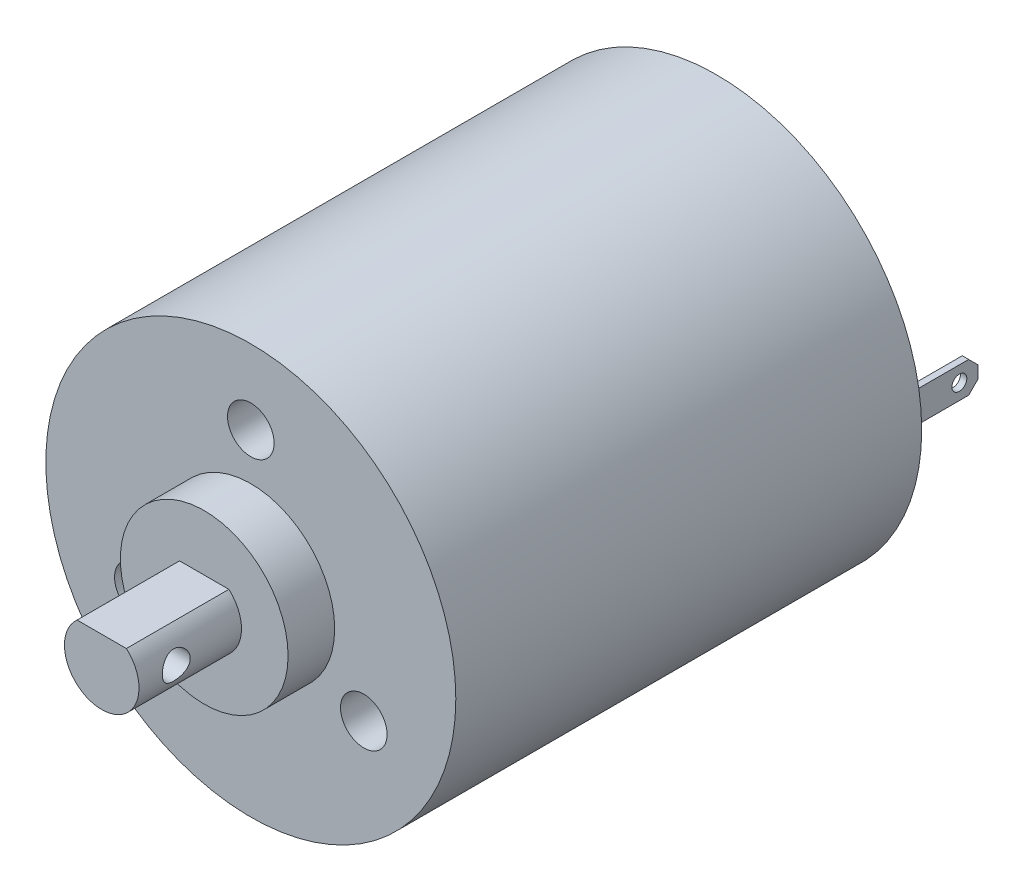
ISO-10303-21;
HEADER;
FILE_DESCRIPTION(('STEP AP214'),'2;1');
FILE_NAME('part.step','',(''),(''),'','','');
FILE_SCHEMA(('AUTOMOTIVE_DESIGN { 1 0 10303 214 1 1 1 1 }'));
ENDSEC;
DATA;
#1=APPLICATION_CONTEXT('core data for automotive mechanical design processes');
#2=APPLICATION_PROTOCOL_DEFINITION('international standard','automotive_design',2000,#1);
#3=PRODUCT_CONTEXT('',#1,'mechanical');
#4=PRODUCT('Part','Part','',(#3));
#5=PRODUCT_RELATED_PRODUCT_CATEGORY('part','',(#4));
#6=PRODUCT_DEFINITION_FORMATION('','',#4);
#7=PRODUCT_DEFINITION_CONTEXT('part definition',#1,'design');
#8=PRODUCT_DEFINITION('design','',#6,#7);
#9=PRODUCT_DEFINITION_SHAPE('','',#8);
#10=(LENGTH_UNIT() NAMED_UNIT(*) SI_UNIT(.MILLI.,.METRE.));
#11=(NAMED_UNIT(*) PLANE_ANGLE_UNIT() SI_UNIT($,.RADIAN.));
#12=(NAMED_UNIT(*) SI_UNIT($,.STERADIAN.) SOLID_ANGLE_UNIT());
#13=UNCERTAINTY_MEASURE_WITH_UNIT(LENGTH_MEASURE(1.E-05),#10,'distance_accuracy_value','');
#14=(GEOMETRIC_REPRESENTATION_CONTEXT(3) GLOBAL_UNCERTAINTY_ASSIGNED_CONTEXT((#13)) GLOBAL_UNIT_ASSIGNED_CONTEXT((#10,
#11,#12)) REPRESENTATION_CONTEXT('',''));
#15=CARTESIAN_POINT('',(0.,0.,0.));
#16=DIRECTION('',(0.,0.,1.));
#17=DIRECTION('',(1.,0.,0.));
#18=AXIS2_PLACEMENT_3D('',#15,#16,#17);
#19=CARTESIAN_POINT('',(0.,0.,-25.));
#20=DIRECTION('',(0.,0.,1.));
#21=DIRECTION('',(1.,0.,0.));
#22=AXIS2_PLACEMENT_3D('',#19,#20,#21);
#23=PLANE('',#22);
#24=DIRECTION('',(0.,-1.,0.));
#25=VECTOR('',#24,1.);
#26=CARTESIAN_POINT('',(9.82023130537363,0.832619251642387,-25.));
#27=LINE('',#26,#25);
#28=CARTESIAN_POINT('',(9.82023130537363,0.832619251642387,-25.));
#29=VERTEX_POINT('',#28);
#30=CARTESIAN_POINT('',(9.82023130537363,-0.832619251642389,-25.));
#31=VERTEX_POINT('',#30);
#32=EDGE_CURVE('E173',#29,#31,#27,.T.);
#33=ORIENTED_EDGE('',*,*,#32,.F.);
#34=DIRECTION('',(1.,0.,0.));
#35=VECTOR('',#34,1.);
#36=CARTESIAN_POINT('',(9.82023130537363,0.832619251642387,-25.));
#37=LINE('',#36,#35);
#38=CARTESIAN_POINT('',(9.47528495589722,0.832619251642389,-25.));
#39=VERTEX_POINT('',#38);
#40=EDGE_CURVE('E182',#39,#29,#37,.T.);
#41=ORIENTED_EDGE('',*,*,#40,.F.);
#42=DIRECTION('',(0.,1.,0.));
#43=VECTOR('',#42,1.);
#44=CARTESIAN_POINT('',(9.47528495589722,0.832619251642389,-25.));
#45=LINE('',#44,#43);
#46=CARTESIAN_POINT('',(9.47528495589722,-0.832619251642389,-25.));
#47=VERTEX_POINT('',#46);
#48=EDGE_CURVE('E179',#47,#39,#45,.T.);
#49=ORIENTED_EDGE('',*,*,#48,.F.);
#50=DIRECTION('',(-1.,0.,0.));
#51=VECTOR('',#50,1.);
#52=CARTESIAN_POINT('',(9.82023130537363,-0.832619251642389,-25.));
#53=LINE('',#52,#51);
#54=EDGE_CURVE('E176',#31,#47,#53,.T.);
#55=ORIENTED_EDGE('',*,*,#54,.F.);
#56=EDGE_LOOP('',(#33,#41,#49,#55));
#57=FACE_BOUND('',#56,.T.);
#58=CARTESIAN_POINT('',(0.,0.,-25.));
#59=DIRECTION('',(0.,0.,1.));
#60=DIRECTION('',(1.,0.,0.));
#61=AXIS2_PLACEMENT_3D('',#58,#59,#60);
#62=CIRCLE('',#61,11.);
#63=CARTESIAN_POINT('',(11.,0.,-25.));
#64=VERTEX_POINT('',#63);
#65=EDGE_CURVE('E242',#64,#64,#62,.T.);
#66=ORIENTED_EDGE('',*,*,#65,.F.);
#67=EDGE_LOOP('',(#66));
#68=FACE_BOUND('',#67,.T.);
#69=DIRECTION('',(1.,0.,0.));
#70=VECTOR('',#69,1.);
#71=CARTESIAN_POINT('',(-9.82023130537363,0.832619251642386,-25.));
#72=LINE('',#71,#70);
#73=CARTESIAN_POINT('',(-9.82023130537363,0.832619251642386,-25.));
#74=VERTEX_POINT('',#73);
#75=CARTESIAN_POINT('',(-9.47528495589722,0.832619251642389,-25.));
#76=VERTEX_POINT('',#75);
#77=EDGE_CURVE('E138',#74,#76,#72,.T.);
#78=ORIENTED_EDGE('',*,*,#77,.F.);
#79=DIRECTION('',(0.,1.,0.));
#80=VECTOR('',#79,1.);
#81=CARTESIAN_POINT('',(-9.82023130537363,0.832619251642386,-25.));
#82=LINE('',#81,#80);
#83=CARTESIAN_POINT('',(-9.82023130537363,-0.832619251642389,-25.));
#84=VERTEX_POINT('',#83);
#85=EDGE_CURVE('E150',#84,#74,#82,.T.);
#86=ORIENTED_EDGE('',*,*,#85,.F.);
#87=DIRECTION('',(-1.,0.,0.));
#88=VECTOR('',#87,1.);
#89=CARTESIAN_POINT('',(-9.82023130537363,-0.832619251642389,-25.));
#90=LINE('',#89,#88);
#91=CARTESIAN_POINT('',(-9.47528495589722,-0.832619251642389,-25.));
#92=VERTEX_POINT('',#91);
#93=EDGE_CURVE('E159',#92,#84,#90,.T.);
#94=ORIENTED_EDGE('',*,*,#93,.F.);
#95=DIRECTION('',(0.,-1.,0.));
#96=VECTOR('',#95,1.);
#97=CARTESIAN_POINT('',(-9.47528495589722,0.832619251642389,-25.));
#98=LINE('',#97,#96);
#99=EDGE_CURVE('E153',#76,#92,#98,.T.);
#100=ORIENTED_EDGE('',*,*,#99,.F.);
#101=EDGE_LOOP('',(#78,#86,#94,#100));
#102=FACE_BOUND('',#101,.T.);
#103=ADVANCED_FACE('F34',(#57,#68,#102),#23,.F.);
#104=CARTESIAN_POINT('',(0.,0.,0.));
#105=DIRECTION('',(0.,0.,1.));
#106=DIRECTION('',(1.,0.,0.));
#107=AXIS2_PLACEMENT_3D('',#104,#105,#106);
#108=PLANE('',#107);
#109=CARTESIAN_POINT('',(0.,0.,0.));
#110=DIRECTION('',(0.,0.,1.));
#111=DIRECTION('',(1.,0.,0.));
#112=AXIS2_PLACEMENT_3D('',#109,#110,#111);
#113=CIRCLE('',#112,11.);
#114=CARTESIAN_POINT('',(11.,0.,0.));
#115=VERTEX_POINT('',#114);
#116=EDGE_CURVE('E239',#115,#115,#113,.T.);
#117=ORIENTED_EDGE('',*,*,#116,.T.);
#118=EDGE_LOOP('',(#117));
#119=FACE_BOUND('',#118,.T.);
#120=CARTESIAN_POINT('',(0.,7.,0.));
#121=DIRECTION('',(0.,0.,1.));
#122=DIRECTION('',(1.,0.,0.));
#123=AXIS2_PLACEMENT_3D('',#120,#121,#122);
#124=CIRCLE('',#123,1.25);
#125=CARTESIAN_POINT('',(1.25,7.,0.));
#126=VERTEX_POINT('',#125);
#127=EDGE_CURVE('E222',#126,#126,#124,.T.);
#128=ORIENTED_EDGE('',*,*,#127,.F.);
#129=EDGE_LOOP('',(#128));
#130=FACE_BOUND('',#129,.T.);
#131=CARTESIAN_POINT('',(-6.06217782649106,-3.50000000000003,0.));
#132=DIRECTION('',(0.,0.,1.));
#133=DIRECTION('',(-0.500000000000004,0.866025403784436,0.));
#134=AXIS2_PLACEMENT_3D('',#131,#132,#133);
#135=CIRCLE('',#134,1.25);
#136=CARTESIAN_POINT('',(-6.68717782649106,-2.41746824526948,0.));
#137=VERTEX_POINT('',#136);
#138=EDGE_CURVE('E216',#137,#137,#135,.T.);
#139=ORIENTED_EDGE('',*,*,#138,.F.);
#140=EDGE_LOOP('',(#139));
#141=FACE_BOUND('',#140,.T.);
#142=CARTESIAN_POINT('',(6.0621778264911,-3.49999999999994,0.));
#143=DIRECTION('',(0.,0.,1.));
#144=DIRECTION('',(-0.499999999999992,-0.866025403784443,0.));
#145=AXIS2_PLACEMENT_3D('',#142,#143,#144);
#146=CIRCLE('',#145,1.25);
#147=CARTESIAN_POINT('',(5.43717782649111,-4.5825317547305,0.));
#148=VERTEX_POINT('',#147);
#149=EDGE_CURVE('E210',#148,#148,#146,.T.);
#150=ORIENTED_EDGE('',*,*,#149,.F.);
#151=EDGE_LOOP('',(#150));
#152=FACE_BOUND('',#151,.T.);
#153=CARTESIAN_POINT('',(0.,0.,0.));
#154=DIRECTION('',(0.,0.,1.));
#155=DIRECTION('',(1.,0.,0.));
#156=AXIS2_PLACEMENT_3D('',#153,#154,#155);
#157=CIRCLE('',#156,4.5);
#158=CARTESIAN_POINT('',(4.5,0.,0.));
#159=VERTEX_POINT('',#158);
#160=EDGE_CURVE('E200',#159,#159,#157,.T.);
#161=ORIENTED_EDGE('',*,*,#160,.F.);
#162=EDGE_LOOP('',(#161));
#163=FACE_BOUND('',#162,.T.);
#164=ADVANCED_FACE('F316',(#119,#130,#141,#152,#163),#108,.T.);
#165=CARTESIAN_POINT('',(0.,0.,-25.));
#166=DIRECTION('',(0.,0.,1.));
#167=DIRECTION('',(1.,0.,0.));
#168=AXIS2_PLACEMENT_3D('',#165,#166,#167);
#169=CYLINDRICAL_SURFACE('',#168,11.);
#170=ORIENTED_EDGE('',*,*,#65,.T.);
#171=EDGE_LOOP('',(#170));
#172=FACE_BOUND('',#171,.T.);
#173=ORIENTED_EDGE('',*,*,#116,.F.);
#174=EDGE_LOOP('',(#173));
#175=FACE_BOUND('',#174,.T.);
#176=ADVANCED_FACE('F36',(#172,#175),#169,.T.);
#177=CARTESIAN_POINT('',(0.,7.,-4.));
#178=DIRECTION('',(0.,0.,1.));
#179=DIRECTION('',(1.,0.,0.));
#180=AXIS2_PLACEMENT_3D('',#177,#178,#179);
#181=CYLINDRICAL_SURFACE('',#180,1.25);
#182=CARTESIAN_POINT('',(0.,7.,-4.));
#183=DIRECTION('',(0.,0.,1.));
#184=DIRECTION('',(1.,0.,0.));
#185=AXIS2_PLACEMENT_3D('',#182,#183,#184);
#186=CIRCLE('',#185,1.25);
#187=CARTESIAN_POINT('',(1.25,7.,-4.));
#188=VERTEX_POINT('',#187);
#189=EDGE_CURVE('E225',#188,#188,#186,.T.);
#190=ORIENTED_EDGE('',*,*,#189,.F.);
#191=EDGE_LOOP('',(#190));
#192=FACE_BOUND('',#191,.T.);
#193=ORIENTED_EDGE('',*,*,#127,.T.);
#194=EDGE_LOOP('',(#193));
#195=FACE_BOUND('',#194,.T.);
#196=ADVANCED_FACE('F301',(#192,#195),#181,.F.);
#197=CARTESIAN_POINT('',(0.,7.,-4.));
#198=DIRECTION('',(0.,0.,1.));
#199=DIRECTION('',(1.,0.,0.));
#200=AXIS2_PLACEMENT_3D('',#197,#198,#199);
#201=PLANE('',#200);
#202=ORIENTED_EDGE('',*,*,#189,.T.);
#203=EDGE_LOOP('',(#202));
#204=FACE_BOUND('',#203,.T.);
#205=ADVANCED_FACE('F297',(#204),#201,.T.);
#206=CARTESIAN_POINT('',(-6.06217782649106,-3.50000000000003,-4.));
#207=DIRECTION('',(0.,0.,1.));
#208=DIRECTION('',(1.,0.,0.));
#209=AXIS2_PLACEMENT_3D('',#206,#207,#208);
#210=CYLINDRICAL_SURFACE('',#209,1.25);
#211=CARTESIAN_POINT('',(-6.06217782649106,-3.50000000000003,-4.));
#212=DIRECTION('',(0.,0.,1.));
#213=DIRECTION('',(-0.500000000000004,0.866025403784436,0.));
#214=AXIS2_PLACEMENT_3D('',#211,#212,#213);
#215=CIRCLE('',#214,1.25);
#216=CARTESIAN_POINT('',(-6.68717782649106,-2.41746824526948,-4.));
#217=VERTEX_POINT('',#216);
#218=EDGE_CURVE('E219',#217,#217,#215,.T.);
#219=ORIENTED_EDGE('',*,*,#218,.F.);
#220=EDGE_LOOP('',(#219));
#221=FACE_BOUND('',#220,.T.);
#222=ORIENTED_EDGE('',*,*,#138,.T.);
#223=EDGE_LOOP('',(#222));
#224=FACE_BOUND('',#223,.T.);
#225=ADVANCED_FACE('F293',(#221,#224),#210,.F.);
#226=CARTESIAN_POINT('',(-6.06217782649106,-3.50000000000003,-4.));
#227=DIRECTION('',(0.,0.,1.));
#228=DIRECTION('',(-0.500000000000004,0.866025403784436,0.));
#229=AXIS2_PLACEMENT_3D('',#226,#227,#228);
#230=PLANE('',#229);
#231=ORIENTED_EDGE('',*,*,#218,.T.);
#232=EDGE_LOOP('',(#231));
#233=FACE_BOUND('',#232,.T.);
#234=ADVANCED_FACE('F289',(#233),#230,.T.);
#235=CARTESIAN_POINT('',(6.0621778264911,-3.49999999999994,-4.));
#236=DIRECTION('',(0.,0.,1.));
#237=DIRECTION('',(1.,0.,0.));
#238=AXIS2_PLACEMENT_3D('',#235,#236,#237);
#239=CYLINDRICAL_SURFACE('',#238,1.25);
#240=CARTESIAN_POINT('',(6.0621778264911,-3.49999999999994,-4.));
#241=DIRECTION('',(0.,0.,1.));
#242=DIRECTION('',(-0.499999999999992,-0.866025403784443,0.));
#243=AXIS2_PLACEMENT_3D('',#240,#241,#242);
#244=CIRCLE('',#243,1.25);
#245=CARTESIAN_POINT('',(5.43717782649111,-4.5825317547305,-4.));
#246=VERTEX_POINT('',#245);
#247=EDGE_CURVE('E213',#246,#246,#244,.T.);
#248=ORIENTED_EDGE('',*,*,#247,.F.);
#249=EDGE_LOOP('',(#248));
#250=FACE_BOUND('',#249,.T.);
#251=ORIENTED_EDGE('',*,*,#149,.T.);
#252=EDGE_LOOP('',(#251));
#253=FACE_BOUND('',#252,.T.);
#254=ADVANCED_FACE('F285',(#250,#253),#239,.F.);
#255=CARTESIAN_POINT('',(6.0621778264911,-3.49999999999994,-4.));
#256=DIRECTION('',(0.,0.,1.));
#257=DIRECTION('',(-0.499999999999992,-0.866025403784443,0.));
#258=AXIS2_PLACEMENT_3D('',#255,#256,#257);
#259=PLANE('',#258);
#260=ORIENTED_EDGE('',*,*,#247,.T.);
#261=EDGE_LOOP('',(#260));
#262=FACE_BOUND('',#261,.T.);
#263=ADVANCED_FACE('F277',(#262),#259,.T.);
#264=CARTESIAN_POINT('',(0.,0.,2.5));
#265=DIRECTION('',(0.,0.,1.));
#266=DIRECTION('',(1.,0.,0.));
#267=AXIS2_PLACEMENT_3D('',#264,#265,#266);
#268=PLANE('',#267);
#269=CARTESIAN_POINT('',(0.,0.,2.5));
#270=DIRECTION('',(0.,0.,1.));
#271=DIRECTION('',(1.,0.,0.));
#272=AXIS2_PLACEMENT_3D('',#269,#270,#271);
#273=CIRCLE('',#272,4.5);
#274=CARTESIAN_POINT('',(4.5,0.,2.5));
#275=VERTEX_POINT('',#274);
#276=EDGE_CURVE('E203',#275,#275,#273,.T.);
#277=ORIENTED_EDGE('',*,*,#276,.T.);
#278=EDGE_LOOP('',(#277));
#279=FACE_BOUND('',#278,.T.);
#280=CARTESIAN_POINT('',(0.,0.,2.5));
#281=DIRECTION('',(0.,0.,1.));
#282=DIRECTION('',(1.,0.,0.));
#283=AXIS2_PLACEMENT_3D('',#280,#281,#282);
#284=CIRCLE('',#283,2.);
#285=CARTESIAN_POINT('',(-1.3228756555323,1.5,2.5));
#286=VERTEX_POINT('',#285);
#287=CARTESIAN_POINT('',(1.32287565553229,1.5,2.5));
#288=VERTEX_POINT('',#287);
#289=EDGE_CURVE('E207',#286,#288,#284,.T.);
#290=ORIENTED_EDGE('',*,*,#289,.F.);
#291=DIRECTION('',(-1.,0.,0.));
#292=VECTOR('',#291,1.);
#293=CARTESIAN_POINT('',(-1.3228756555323,1.5,2.5));
#294=LINE('',#293,#292);
#295=EDGE_CURVE('E245',#288,#286,#294,.T.);
#296=ORIENTED_EDGE('',*,*,#295,.F.);
#297=EDGE_LOOP('',(#290,#296));
#298=FACE_BOUND('',#297,.T.);
#299=ADVANCED_FACE('F272',(#279,#298),#268,.T.);
#300=CARTESIAN_POINT('',(0.,0.,2.5));
#301=DIRECTION('',(0.,0.,-1.));
#302=DIRECTION('',(-1.,0.,0.));
#303=AXIS2_PLACEMENT_3D('',#300,#301,#302);
#304=CYLINDRICAL_SURFACE('',#303,4.5);
#305=ORIENTED_EDGE('',*,*,#276,.F.);
#306=EDGE_LOOP('',(#305));
#307=FACE_BOUND('',#306,.T.);
#308=ORIENTED_EDGE('',*,*,#160,.T.);
#309=EDGE_LOOP('',(#308));
#310=FACE_BOUND('',#309,.T.);
#311=ADVANCED_FACE('F276',(#307,#310),#304,.T.);
#312=CARTESIAN_POINT('',(0.,0.,8.));
#313=DIRECTION('',(0.,0.,1.));
#314=DIRECTION('',(1.,0.,0.));
#315=AXIS2_PLACEMENT_3D('',#312,#313,#314);
#316=PLANE('',#315);
#317=CARTESIAN_POINT('',(0.,0.,8.));
#318=DIRECTION('',(0.,0.,1.));
#319=DIRECTION('',(1.,0.,0.));
#320=AXIS2_PLACEMENT_3D('',#317,#318,#319);
#321=CIRCLE('',#320,2.);
#322=CARTESIAN_POINT('',(-1.3228756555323,1.5,8.));
#323=VERTEX_POINT('',#322);
#324=CARTESIAN_POINT('',(1.3228756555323,1.5,8.));
#325=VERTEX_POINT('',#324);
#326=EDGE_CURVE('E228',#323,#325,#321,.T.);
#327=ORIENTED_EDGE('',*,*,#326,.T.);
#328=DIRECTION('',(-1.,0.,0.));
#329=VECTOR('',#328,1.);
#330=CARTESIAN_POINT('',(-1.3228756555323,1.5,8.));
#331=LINE('',#330,#329);
#332=EDGE_CURVE('E231',#325,#323,#331,.T.);
#333=ORIENTED_EDGE('',*,*,#332,.T.);
#334=EDGE_LOOP('',(#327,#333));
#335=FACE_BOUND('',#334,.T.);
#336=ADVANCED_FACE('F281',(#335),#316,.T.);
#337=CARTESIAN_POINT('',(-1.3228756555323,1.5,8.));
#338=DIRECTION('',(0.,-1.,0.));
#339=DIRECTION('',(0.,0.,-1.));
#340=AXIS2_PLACEMENT_3D('',#337,#338,#339);
#341=PLANE('',#340);
#342=DIRECTION('',(0.,0.,-1.));
#343=VECTOR('',#342,1.);
#344=CARTESIAN_POINT('',(1.3228756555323,1.5,8.));
#345=LINE('',#344,#343);
#346=EDGE_CURVE('E236',#325,#288,#345,.T.);
#347=ORIENTED_EDGE('',*,*,#346,.T.);
#348=ORIENTED_EDGE('',*,*,#295,.T.);
#349=DIRECTION('',(0.,0.,-1.));
#350=VECTOR('',#349,1.);
#351=CARTESIAN_POINT('',(-1.3228756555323,1.5,8.));
#352=LINE('',#351,#350);
#353=EDGE_CURVE('E233',#323,#286,#352,.T.);
#354=ORIENTED_EDGE('',*,*,#353,.F.);
#355=ORIENTED_EDGE('',*,*,#332,.F.);
#356=EDGE_LOOP('',(#347,#348,#354,#355));
#357=FACE_BOUND('',#356,.T.);
#358=ADVANCED_FACE('F307',(#357),#341,.F.);
#359=CARTESIAN_POINT('',(0.,0.,8.));
#360=DIRECTION('',(0.,0.,-1.));
#361=DIRECTION('',(-1.,0.,0.));
#362=AXIS2_PLACEMENT_3D('',#359,#360,#361);
#363=CYLINDRICAL_SURFACE('',#362,2.);
#364=CARTESIAN_POINT('',(-2.,0.,5.25));
#365=CARTESIAN_POINT('',(-2.00000108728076,0.0406175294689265,5.24999854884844));
#366=CARTESIAN_POINT('',(-1.99875189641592,0.0812251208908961,5.25330988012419));
#367=CARTESIAN_POINT('',(-1.99389348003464,0.161226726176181,5.26641409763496));
#368=CARTESIAN_POINT('',(-1.99028459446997,0.200620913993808,5.27620605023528));
#369=CARTESIAN_POINT('',(-1.98109416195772,0.277030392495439,5.30187650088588));
#370=CARTESIAN_POINT('',(-1.9755164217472,0.314050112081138,5.31774325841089));
#371=CARTESIAN_POINT('',(-1.96294383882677,0.384899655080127,5.35505320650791));
#372=CARTESIAN_POINT('',(-1.95594861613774,0.418728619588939,5.37649789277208));
#373=CARTESIAN_POINT('',(-1.94093123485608,0.483673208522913,5.42530626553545));
#374=CARTESIAN_POINT('',(-1.93288001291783,0.514635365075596,5.4528651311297));
#375=CARTESIAN_POINT('',(-1.91680110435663,0.571622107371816,5.51270521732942));
#376=CARTESIAN_POINT('',(-1.90877342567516,0.597645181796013,5.54498787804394));
#377=CARTESIAN_POINT('',(-1.89331235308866,0.644991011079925,5.6148587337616));
#378=CARTESIAN_POINT('',(-1.88591324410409,0.666096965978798,5.65260218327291));
#379=CARTESIAN_POINT('',(-1.87299930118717,0.701593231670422,5.73142417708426));
#380=CARTESIAN_POINT('',(-1.8674837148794,0.715986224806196,5.77250138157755));
#381=CARTESIAN_POINT('',(-1.85927206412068,0.737042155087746,5.8550583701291));
#382=CARTESIAN_POINT('',(-1.85646962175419,0.743997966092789,5.89645251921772));
#383=CARTESIAN_POINT('',(-1.85369030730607,0.75089778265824,5.97990807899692));
#384=CARTESIAN_POINT('',(-1.85371226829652,0.750844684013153,6.02196920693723));
#385=CARTESIAN_POINT('',(-1.85648755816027,0.743952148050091,6.10288476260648));
#386=CARTESIAN_POINT('',(-1.85907734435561,0.737519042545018,6.14178045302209));
#387=CARTESIAN_POINT('',(-1.86642469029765,0.71872083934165,6.21789357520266));
#388=CARTESIAN_POINT('',(-1.87118257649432,0.706354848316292,6.25511075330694));
#389=CARTESIAN_POINT('',(-1.88242851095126,0.67581874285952,6.32763853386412));
#390=CARTESIAN_POINT('',(-1.88894758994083,0.657543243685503,6.36289974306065));
#391=CARTESIAN_POINT('',(-1.9029710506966,0.615780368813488,6.42997286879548));
#392=CARTESIAN_POINT('',(-1.91047577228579,0.592291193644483,6.46178358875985));
#393=CARTESIAN_POINT('',(-1.92624019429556,0.538908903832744,6.52330183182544));
#394=CARTESIAN_POINT('',(-1.93451673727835,0.508691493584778,6.55272432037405));
#395=CARTESIAN_POINT('',(-1.95045864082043,0.44365629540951,6.6061689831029));
#396=CARTESIAN_POINT('',(-1.95812390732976,0.408837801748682,6.63019032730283));
#397=CARTESIAN_POINT('',(-1.9721319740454,0.33486171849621,6.67246519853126));
#398=CARTESIAN_POINT('',(-1.97845249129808,0.29564535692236,6.69062379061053));
#399=CARTESIAN_POINT('',(-1.98889359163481,0.214418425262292,6.71999130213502));
#400=CARTESIAN_POINT('',(-1.99301515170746,0.172409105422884,6.73120330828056));
#401=CARTESIAN_POINT('',(-1.99842221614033,0.0891876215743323,6.74581139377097));
#402=CARTESIAN_POINT('',(-1.99984684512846,0.0480518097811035,6.74959130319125));
#403=CARTESIAN_POINT('',(-2.0001294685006,-0.0342862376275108,6.75034553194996));
#404=CARTESIAN_POINT('',(-1.99898803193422,-0.0754884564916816,6.7473213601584));
#405=CARTESIAN_POINT('',(-1.99435854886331,-0.155131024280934,6.73484497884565));
#406=CARTESIAN_POINT('',(-1.99096235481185,-0.193616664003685,6.72564422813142));
#407=CARTESIAN_POINT('',(-1.98225738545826,-0.268470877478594,6.70140696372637));
#408=CARTESIAN_POINT('',(-1.97694836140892,-0.304839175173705,6.68636969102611));
#409=CARTESIAN_POINT('',(-1.96474812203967,-0.375623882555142,6.65040679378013));
#410=CARTESIAN_POINT('',(-1.95781500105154,-0.409951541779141,6.62932113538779));
#411=CARTESIAN_POINT('',(-1.94313335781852,-0.474696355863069,6.58204094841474));
#412=CARTESIAN_POINT('',(-1.93538453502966,-0.505112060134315,6.55584453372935));
#413=CARTESIAN_POINT('',(-1.91936664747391,-0.563015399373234,6.49729793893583));
#414=CARTESIAN_POINT('',(-1.91109348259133,-0.590230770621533,6.46467890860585));
#415=CARTESIAN_POINT('',(-1.89539407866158,-0.638855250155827,6.39517430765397));
#416=CARTESIAN_POINT('',(-1.88796791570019,-0.660263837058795,6.35828835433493));
#417=CARTESIAN_POINT('',(-1.87483414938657,-0.696688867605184,6.28099200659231));
#418=CARTESIAN_POINT('',(-1.86913380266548,-0.711678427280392,6.24056762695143));
#419=CARTESIAN_POINT('',(-1.86027016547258,-0.734539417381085,6.15749511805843));
#420=CARTESIAN_POINT('',(-1.85710530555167,-0.742415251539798,6.11484838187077));
#421=CARTESIAN_POINT('',(-1.85387947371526,-0.750431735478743,6.03149192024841));
#422=CARTESIAN_POINT('',(-1.85363222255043,-0.751036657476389,5.99083368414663));
#423=CARTESIAN_POINT('',(-1.85579206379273,-0.745683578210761,5.91002734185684));
#424=CARTESIAN_POINT('',(-1.858198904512,-0.739726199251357,5.86987918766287));
#425=CARTESIAN_POINT('',(-1.86524070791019,-0.721779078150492,5.79247638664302));
#426=CARTESIAN_POINT('',(-1.86980542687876,-0.709978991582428,5.75517082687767));
#427=CARTESIAN_POINT('',(-1.88060774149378,-0.680848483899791,5.68304724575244));
#428=CARTESIAN_POINT('',(-1.88684575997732,-0.663516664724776,5.64822985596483));
#429=CARTESIAN_POINT('',(-1.90069861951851,-0.622760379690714,5.58008660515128));
#430=CARTESIAN_POINT('',(-1.90836849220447,-0.599064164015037,5.54693460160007));
#431=CARTESIAN_POINT('',(-1.92403123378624,-0.546672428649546,5.48492921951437));
#432=CARTESIAN_POINT('',(-1.93202420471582,-0.517975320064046,5.45607721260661));
#433=CARTESIAN_POINT('',(-1.9479521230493,-0.454540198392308,5.40189902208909));
#434=CARTESIAN_POINT('',(-1.9558605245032,-0.419559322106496,5.37684812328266));
#435=CARTESIAN_POINT('',(-1.97027257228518,-0.345606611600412,5.33298867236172));
#436=CARTESIAN_POINT('',(-1.9767761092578,-0.306634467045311,5.31418060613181));
#437=CARTESIAN_POINT('',(-1.98787146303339,-0.223999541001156,5.28281158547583));
#438=CARTESIAN_POINT('',(-1.99236828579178,-0.180206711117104,5.27055646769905));
#439=CARTESIAN_POINT('',(-1.99843121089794,-0.090937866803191,5.25415352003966));
#440=CARTESIAN_POINT('',(-1.99999878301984,-0.0454627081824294,5.25000162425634));
#441=CARTESIAN_POINT('',(-2.,0.,5.25));
#442=B_SPLINE_CURVE_WITH_KNOTS('',3,(#364,#365,#366,#367,#368,#369,#370,#371,#372,#373,#374,
#375,#376,#377,#378,#379,#380,#381,#382,#383,#384,#385,#386,#387,#388,#389,#390,#391,#392,#393,
#394,#395,#396,#397,#398,#399,#400,#401,#402,#403,#404,#405,#406,#407,#408,#409,#410,#411,#412,
#413,#414,#415,#416,#417,#418,#419,#420,#421,#422,#423,#424,#425,#426,#427,#428,#429,#430,#431,
#432,#433,#434,#435,#436,#437,#438,#439,#440,#441),.UNSPECIFIED.,.T.,.F.,(4,2,2,2,2,2,2,2,2,2,2,
2,2,2,2,2,2,2,2,2,2,2,2,2,2,2,2,2,2,2,2,2,2,2,2,2,2,2,4),(0.,0.12168490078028,0.24335227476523,
0.364785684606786,0.486251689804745,0.612368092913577,0.738523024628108,0.869483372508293,
1.00039134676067,1.12592937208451,1.25141553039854,1.36939172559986,1.48738569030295,
1.60761204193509,1.72787995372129,1.85623076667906,1.98460128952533,2.11495687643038,
2.24525449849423,2.36862509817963,2.4919683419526,2.6105721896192,2.72919146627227,
2.851296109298,2.97344590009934,3.10268259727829,3.23193089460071,3.36171533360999,
3.49141937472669,3.61279381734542,3.73415675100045,3.85181571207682,3.96950443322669,
4.09336235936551,4.21725970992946,4.34786164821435,4.47847374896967,4.61474257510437,
4.75094300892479),.UNSPECIFIED.);
#443=CARTESIAN_POINT('',(-2.,0.,5.25));
#444=VERTEX_POINT('',#443);
#445=EDGE_CURVE('E204',#444,#444,#442,.T.);
#446=ORIENTED_EDGE('',*,*,#445,.T.);
#447=EDGE_LOOP('',(#446));
#448=FACE_BOUND('',#447,.T.);
#449=CARTESIAN_POINT('',(2.,0.,5.25));
#450=CARTESIAN_POINT('',(2.00000108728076,-0.0406175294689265,5.24999854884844));
#451=CARTESIAN_POINT('',(1.99875189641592,-0.0812251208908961,5.25330988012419));
#452=CARTESIAN_POINT('',(1.99389348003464,-0.161226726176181,5.26641409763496));
#453=CARTESIAN_POINT('',(1.99028459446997,-0.200620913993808,5.27620605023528));
#454=CARTESIAN_POINT('',(1.98109416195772,-0.277030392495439,5.30187650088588));
#455=CARTESIAN_POINT('',(1.9755164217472,-0.314050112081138,5.31774325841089));
#456=CARTESIAN_POINT('',(1.96294383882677,-0.384899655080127,5.35505320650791));
#457=CARTESIAN_POINT('',(1.95594861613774,-0.418728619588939,5.37649789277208));
#458=CARTESIAN_POINT('',(1.94093123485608,-0.483673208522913,5.42530626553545));
#459=CARTESIAN_POINT('',(1.93288001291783,-0.514635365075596,5.4528651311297));
#460=CARTESIAN_POINT('',(1.91680110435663,-0.571622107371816,5.51270521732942));
#461=CARTESIAN_POINT('',(1.90877342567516,-0.597645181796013,5.54498787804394));
#462=CARTESIAN_POINT('',(1.89331235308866,-0.644991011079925,5.6148587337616));
#463=CARTESIAN_POINT('',(1.88591324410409,-0.666096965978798,5.65260218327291));
#464=CARTESIAN_POINT('',(1.87299930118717,-0.701593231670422,5.73142417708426));
#465=CARTESIAN_POINT('',(1.8674837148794,-0.715986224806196,5.77250138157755));
#466=CARTESIAN_POINT('',(1.85927206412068,-0.737042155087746,5.8550583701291));
#467=CARTESIAN_POINT('',(1.85646962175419,-0.743997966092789,5.89645251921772));
#468=CARTESIAN_POINT('',(1.85369030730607,-0.75089778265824,5.97990807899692));
#469=CARTESIAN_POINT('',(1.85371226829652,-0.750844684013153,6.02196920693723));
#470=CARTESIAN_POINT('',(1.85648755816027,-0.743952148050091,6.10288476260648));
#471=CARTESIAN_POINT('',(1.85907734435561,-0.737519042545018,6.14178045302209));
#472=CARTESIAN_POINT('',(1.86642469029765,-0.71872083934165,6.21789357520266));
#473=CARTESIAN_POINT('',(1.87118257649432,-0.706354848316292,6.25511075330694));
#474=CARTESIAN_POINT('',(1.88242851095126,-0.67581874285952,6.32763853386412));
#475=CARTESIAN_POINT('',(1.88894758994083,-0.657543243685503,6.36289974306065));
#476=CARTESIAN_POINT('',(1.9029710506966,-0.615780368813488,6.42997286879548));
#477=CARTESIAN_POINT('',(1.91047577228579,-0.592291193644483,6.46178358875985));
#478=CARTESIAN_POINT('',(1.92624019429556,-0.538908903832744,6.52330183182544));
#479=CARTESIAN_POINT('',(1.93451673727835,-0.508691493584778,6.55272432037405));
#480=CARTESIAN_POINT('',(1.95045864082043,-0.44365629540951,6.6061689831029));
#481=CARTESIAN_POINT('',(1.95812390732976,-0.408837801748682,6.63019032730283));
#482=CARTESIAN_POINT('',(1.9721319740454,-0.33486171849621,6.67246519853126));
#483=CARTESIAN_POINT('',(1.97845249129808,-0.29564535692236,6.69062379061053));
#484=CARTESIAN_POINT('',(1.98889359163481,-0.214418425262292,6.71999130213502));
#485=CARTESIAN_POINT('',(1.99301515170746,-0.172409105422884,6.73120330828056));
#486=CARTESIAN_POINT('',(1.99842221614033,-0.0891876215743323,6.74581139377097));
#487=CARTESIAN_POINT('',(1.99984684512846,-0.0480518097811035,6.74959130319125));
#488=CARTESIAN_POINT('',(2.0001294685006,0.0342862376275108,6.75034553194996));
#489=CARTESIAN_POINT('',(1.99898803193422,0.0754884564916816,6.7473213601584));
#490=CARTESIAN_POINT('',(1.99435854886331,0.155131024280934,6.73484497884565));
#491=CARTESIAN_POINT('',(1.99096235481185,0.193616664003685,6.72564422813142));
#492=CARTESIAN_POINT('',(1.98225738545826,0.268470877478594,6.70140696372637));
#493=CARTESIAN_POINT('',(1.97694836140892,0.304839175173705,6.68636969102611));
#494=CARTESIAN_POINT('',(1.96474812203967,0.375623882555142,6.65040679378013));
#495=CARTESIAN_POINT('',(1.95781500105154,0.409951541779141,6.62932113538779));
#496=CARTESIAN_POINT('',(1.94313335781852,0.474696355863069,6.58204094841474));
#497=CARTESIAN_POINT('',(1.93538453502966,0.505112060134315,6.55584453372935));
#498=CARTESIAN_POINT('',(1.91936664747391,0.563015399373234,6.49729793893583));
#499=CARTESIAN_POINT('',(1.91109348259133,0.590230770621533,6.46467890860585));
#500=CARTESIAN_POINT('',(1.89539407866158,0.638855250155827,6.39517430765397));
#501=CARTESIAN_POINT('',(1.88796791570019,0.660263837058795,6.35828835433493));
#502=CARTESIAN_POINT('',(1.87483414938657,0.696688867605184,6.28099200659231));
#503=CARTESIAN_POINT('',(1.86913380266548,0.711678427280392,6.24056762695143));
#504=CARTESIAN_POINT('',(1.86027016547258,0.734539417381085,6.15749511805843));
#505=CARTESIAN_POINT('',(1.85710530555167,0.742415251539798,6.11484838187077));
#506=CARTESIAN_POINT('',(1.85387947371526,0.750431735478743,6.03149192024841));
#507=CARTESIAN_POINT('',(1.85363222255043,0.751036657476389,5.99083368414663));
#508=CARTESIAN_POINT('',(1.85579206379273,0.745683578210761,5.91002734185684));
#509=CARTESIAN_POINT('',(1.858198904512,0.739726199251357,5.86987918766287));
#510=CARTESIAN_POINT('',(1.86524070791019,0.721779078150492,5.79247638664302));
#511=CARTESIAN_POINT('',(1.86980542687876,0.709978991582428,5.75517082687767));
#512=CARTESIAN_POINT('',(1.88060774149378,0.680848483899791,5.68304724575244));
#513=CARTESIAN_POINT('',(1.88684575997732,0.663516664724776,5.64822985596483));
#514=CARTESIAN_POINT('',(1.90069861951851,0.622760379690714,5.58008660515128));
#515=CARTESIAN_POINT('',(1.90836849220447,0.599064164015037,5.54693460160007));
#516=CARTESIAN_POINT('',(1.92403123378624,0.546672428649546,5.48492921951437));
#517=CARTESIAN_POINT('',(1.93202420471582,0.517975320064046,5.45607721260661));
#518=CARTESIAN_POINT('',(1.9479521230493,0.454540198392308,5.40189902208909));
#519=CARTESIAN_POINT('',(1.9558605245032,0.419559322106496,5.37684812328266));
#520=CARTESIAN_POINT('',(1.97027257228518,0.345606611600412,5.33298867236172));
#521=CARTESIAN_POINT('',(1.9767761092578,0.306634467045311,5.31418060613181));
#522=CARTESIAN_POINT('',(1.98787146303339,0.223999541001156,5.28281158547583));
#523=CARTESIAN_POINT('',(1.99236828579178,0.180206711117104,5.27055646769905));
#524=CARTESIAN_POINT('',(1.99843121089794,0.090937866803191,5.25415352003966));
#525=CARTESIAN_POINT('',(1.99999878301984,0.0454627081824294,5.25000162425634));
#526=CARTESIAN_POINT('',(2.,0.,5.25));
#527=B_SPLINE_CURVE_WITH_KNOTS('',3,(#449,#450,#451,#452,#453,#454,#455,#456,#457,#458,#459,
#460,#461,#462,#463,#464,#465,#466,#467,#468,#469,#470,#471,#472,#473,#474,#475,#476,#477,#478,
#479,#480,#481,#482,#483,#484,#485,#486,#487,#488,#489,#490,#491,#492,#493,#494,#495,#496,#497,
#498,#499,#500,#501,#502,#503,#504,#505,#506,#507,#508,#509,#510,#511,#512,#513,#514,#515,#516,
#517,#518,#519,#520,#521,#522,#523,#524,#525,#526),.UNSPECIFIED.,.T.,.F.,(4,2,2,2,2,2,2,2,2,2,2,
2,2,2,2,2,2,2,2,2,2,2,2,2,2,2,2,2,2,2,2,2,2,2,2,2,2,2,4),(0.,0.12168490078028,0.24335227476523,
0.364785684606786,0.486251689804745,0.612368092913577,0.738523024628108,0.869483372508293,
1.00039134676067,1.12592937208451,1.25141553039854,1.36939172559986,1.48738569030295,
1.60761204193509,1.72787995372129,1.85623076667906,1.98460128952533,2.11495687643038,
2.24525449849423,2.36862509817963,2.4919683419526,2.6105721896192,2.72919146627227,
2.851296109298,2.97344590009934,3.10268259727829,3.23193089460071,3.36171533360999,
3.49141937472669,3.61279381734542,3.73415675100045,3.85181571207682,3.96950443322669,
4.09336235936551,4.21725970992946,4.34786164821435,4.47847374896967,4.61474257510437,
4.75094300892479),.UNSPECIFIED.);
#528=CARTESIAN_POINT('',(2.,0.,5.25));
#529=VERTEX_POINT('',#528);
#530=EDGE_CURVE('E199',#529,#529,#527,.T.);
#531=ORIENTED_EDGE('',*,*,#530,.T.);
#532=EDGE_LOOP('',(#531));
#533=FACE_BOUND('',#532,.T.);
#534=ORIENTED_EDGE('',*,*,#353,.T.);
#535=ORIENTED_EDGE('',*,*,#289,.T.);
#536=ORIENTED_EDGE('',*,*,#346,.F.);
#537=ORIENTED_EDGE('',*,*,#326,.F.);
#538=EDGE_LOOP('',(#534,#535,#536,#537));
#539=FACE_BOUND('',#538,.T.);
#540=ADVANCED_FACE('F260',(#448,#533,#539),#363,.T.);
#541=CARTESIAN_POINT('',(-11.,0.,6.));
#542=DIRECTION('',(1.,0.,0.));
#543=DIRECTION('',(0.,0.,-1.));
#544=AXIS2_PLACEMENT_3D('',#541,#542,#543);
#545=CYLINDRICAL_SURFACE('',#544,0.75);
#546=ORIENTED_EDGE('',*,*,#530,.F.);
#547=EDGE_LOOP('',(#546));
#548=FACE_BOUND('',#547,.T.);
#549=ORIENTED_EDGE('',*,*,#445,.F.);
#550=EDGE_LOOP('',(#549));
#551=FACE_BOUND('',#550,.T.);
#552=ADVANCED_FACE('F264',(#548,#551),#545,.F.);
#553=CARTESIAN_POINT('',(9.82023130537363,0.832619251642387,-29.2));
#554=DIRECTION('',(-1.,0.,0.));
#555=DIRECTION('',(0.,0.,1.));
#556=AXIS2_PLACEMENT_3D('',#553,#554,#555);
#557=PLANE('',#556);
#558=CARTESIAN_POINT('',(9.82023130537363,0.,-28.2));
#559=DIRECTION('',(-1.,0.,0.));
#560=DIRECTION('',(0.,0.,1.));
#561=AXIS2_PLACEMENT_3D('',#558,#559,#560);
#562=CIRCLE('',#561,0.399999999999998);
#563=CARTESIAN_POINT('',(9.82023130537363,0.,-27.8));
#564=VERTEX_POINT('',#563);
#565=EDGE_CURVE('E154',#564,#564,#562,.T.);
#566=ORIENTED_EDGE('',*,*,#565,.T.);
#567=EDGE_LOOP('',(#566));
#568=FACE_BOUND('',#567,.T.);
#569=DIRECTION('',(0.,0.,1.));
#570=VECTOR('',#569,1.);
#571=CARTESIAN_POINT('',(9.82023130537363,-0.832619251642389,-29.2));
#572=LINE('',#571,#570);
#573=CARTESIAN_POINT('',(9.82023130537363,-0.832619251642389,-28.7));
#574=VERTEX_POINT('',#573);
#575=EDGE_CURVE('E197',#574,#31,#572,.T.);
#576=ORIENTED_EDGE('',*,*,#575,.F.);
#577=DIRECTION('',(0.,0.707106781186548,-0.707106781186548));
#578=VECTOR('',#577,1.);
#579=CARTESIAN_POINT('',(9.82023130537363,-0.332619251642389,-29.2));
#580=LINE('',#579,#578);
#581=CARTESIAN_POINT('',(9.82023130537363,-0.332619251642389,-29.2));
#582=VERTEX_POINT('',#581);
#583=EDGE_CURVE('E618',#574,#582,#580,.T.);
#584=ORIENTED_EDGE('',*,*,#583,.T.);
#585=DIRECTION('',(0.,-1.,0.));
#586=VECTOR('',#585,1.);
#587=CARTESIAN_POINT('',(9.82023130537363,0.832619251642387,-29.2));
#588=LINE('',#587,#586);
#589=CARTESIAN_POINT('',(9.82023130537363,0.332619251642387,-29.2));
#590=VERTEX_POINT('',#589);
#591=EDGE_CURVE('E185',#590,#582,#588,.T.);
#592=ORIENTED_EDGE('',*,*,#591,.F.);
#593=DIRECTION('',(0.,0.707106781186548,0.707106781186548));
#594=VECTOR('',#593,1.);
#595=CARTESIAN_POINT('',(9.82023130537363,0.332619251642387,-29.2));
#596=LINE('',#595,#594);
#597=CARTESIAN_POINT('',(9.82023130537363,0.832619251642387,-28.7));
#598=VERTEX_POINT('',#597);
#599=EDGE_CURVE('E625',#590,#598,#596,.T.);
#600=ORIENTED_EDGE('',*,*,#599,.T.);
#601=DIRECTION('',(0.,0.,1.));
#602=VECTOR('',#601,1.);
#603=CARTESIAN_POINT('',(9.82023130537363,0.832619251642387,-29.2));
#604=LINE('',#603,#602);
#605=EDGE_CURVE('E191',#598,#29,#604,.T.);
#606=ORIENTED_EDGE('',*,*,#605,.T.);
#607=ORIENTED_EDGE('',*,*,#32,.T.);
#608=EDGE_LOOP('',(#576,#584,#592,#600,#606,#607));
#609=FACE_BOUND('',#608,.T.);
#610=ADVANCED_FACE('F269',(#568,#609),#557,.F.);
#611=CARTESIAN_POINT('',(9.82023130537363,-0.832619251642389,-29.2));
#612=DIRECTION('',(0.,1.,0.));
#613=DIRECTION('',(0.,0.,1.));
#614=AXIS2_PLACEMENT_3D('',#611,#612,#613);
#615=PLANE('',#614);
#616=DIRECTION('',(0.,0.,1.));
#617=VECTOR('',#616,1.);
#618=CARTESIAN_POINT('',(9.47528495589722,-0.832619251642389,-29.2));
#619=LINE('',#618,#617);
#620=CARTESIAN_POINT('',(9.47528495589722,-0.832619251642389,-28.7));
#621=VERTEX_POINT('',#620);
#622=EDGE_CURVE('E195',#621,#47,#619,.T.);
#623=ORIENTED_EDGE('',*,*,#622,.F.);
#624=DIRECTION('',(1.,0.,0.));
#625=VECTOR('',#624,1.);
#626=CARTESIAN_POINT('',(9.82023130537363,-0.832619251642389,-28.7));
#627=LINE('',#626,#625);
#628=EDGE_CURVE('E621',#621,#574,#627,.T.);
#629=ORIENTED_EDGE('',*,*,#628,.T.);
#630=ORIENTED_EDGE('',*,*,#575,.T.);
#631=ORIENTED_EDGE('',*,*,#54,.T.);
#632=EDGE_LOOP('',(#623,#629,#630,#631));
#633=FACE_BOUND('',#632,.T.);
#634=ADVANCED_FACE('F428',(#633),#615,.F.);
#635=CARTESIAN_POINT('',(9.47528495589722,0.832619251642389,-29.2));
#636=DIRECTION('',(1.,0.,0.));
#637=DIRECTION('',(0.,0.,-1.));
#638=AXIS2_PLACEMENT_3D('',#635,#636,#637);
#639=PLANE('',#638);
#640=CARTESIAN_POINT('',(9.47528495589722,0.,-28.2));
#641=DIRECTION('',(1.,0.,0.));
#642=DIRECTION('',(0.,0.,-1.));
#643=AXIS2_PLACEMENT_3D('',#640,#641,#642);
#644=CIRCLE('',#643,0.399999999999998);
#645=CARTESIAN_POINT('',(9.47528495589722,0.,-28.6));
#646=VERTEX_POINT('',#645);
#647=EDGE_CURVE('E599',#646,#646,#644,.T.);
#648=ORIENTED_EDGE('',*,*,#647,.T.);
#649=EDGE_LOOP('',(#648));
#650=FACE_BOUND('',#649,.T.);
#651=DIRECTION('',(0.,1.,0.));
#652=VECTOR('',#651,1.);
#653=CARTESIAN_POINT('',(9.47528495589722,0.832619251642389,-29.2));
#654=LINE('',#653,#652);
#655=CARTESIAN_POINT('',(9.47528495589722,-0.332619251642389,-29.2));
#656=VERTEX_POINT('',#655);
#657=CARTESIAN_POINT('',(9.47528495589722,0.332619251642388,-29.2));
#658=VERTEX_POINT('',#657);
#659=EDGE_CURVE('E188',#656,#658,#654,.T.);
#660=ORIENTED_EDGE('',*,*,#659,.F.);
#661=DIRECTION('',(0.,-0.707106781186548,0.707106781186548));
#662=VECTOR('',#661,1.);
#663=CARTESIAN_POINT('',(9.47528495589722,-0.332619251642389,-29.2));
#664=LINE('',#663,#662);
#665=EDGE_CURVE('E631',#656,#621,#664,.T.);
#666=ORIENTED_EDGE('',*,*,#665,.T.);
#667=ORIENTED_EDGE('',*,*,#622,.T.);
#668=ORIENTED_EDGE('',*,*,#48,.T.);
#669=DIRECTION('',(0.,0.,1.));
#670=VECTOR('',#669,1.);
#671=CARTESIAN_POINT('',(9.47528495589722,0.832619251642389,-29.2));
#672=LINE('',#671,#670);
#673=CARTESIAN_POINT('',(9.47528495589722,0.832619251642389,-28.7));
#674=VERTEX_POINT('',#673);
#675=EDGE_CURVE('E193',#674,#39,#672,.T.);
#676=ORIENTED_EDGE('',*,*,#675,.F.);
#677=DIRECTION('',(0.,-0.707106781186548,-0.707106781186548));
#678=VECTOR('',#677,1.);
#679=CARTESIAN_POINT('',(9.47528495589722,0.332619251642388,-29.2));
#680=LINE('',#679,#678);
#681=EDGE_CURVE('E633',#674,#658,#680,.T.);
#682=ORIENTED_EDGE('',*,*,#681,.T.);
#683=EDGE_LOOP('',(#660,#666,#667,#668,#676,#682));
#684=FACE_BOUND('',#683,.T.);
#685=ADVANCED_FACE('F437',(#650,#684),#639,.F.);
#686=CARTESIAN_POINT('',(9.82023130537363,0.832619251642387,-29.2));
#687=DIRECTION('',(0.,-1.,0.));
#688=DIRECTION('',(1.,0.,0.));
#689=AXIS2_PLACEMENT_3D('',#686,#687,#688);
#690=PLANE('',#689);
#691=ORIENTED_EDGE('',*,*,#605,.F.);
#692=DIRECTION('',(-1.,0.,0.));
#693=VECTOR('',#692,1.);
#694=CARTESIAN_POINT('',(9.47528495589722,0.832619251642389,-28.7));
#695=LINE('',#694,#693);
#696=EDGE_CURVE('E624',#598,#674,#695,.T.);
#697=ORIENTED_EDGE('',*,*,#696,.T.);
#698=ORIENTED_EDGE('',*,*,#675,.T.);
#699=ORIENTED_EDGE('',*,*,#40,.T.);
#700=EDGE_LOOP('',(#691,#697,#698,#699));
#701=FACE_BOUND('',#700,.T.);
#702=ADVANCED_FACE('F445',(#701),#690,.F.);
#703=CARTESIAN_POINT('',(9.82023130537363,-0.832619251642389,-29.2));
#704=DIRECTION('',(0.,0.,-1.));
#705=DIRECTION('',(-1.,0.,0.));
#706=AXIS2_PLACEMENT_3D('',#703,#704,#705);
#707=PLANE('',#706);
#708=ORIENTED_EDGE('',*,*,#591,.T.);
#709=DIRECTION('',(-1.,0.,0.));
#710=VECTOR('',#709,1.);
#711=CARTESIAN_POINT('',(9.47528495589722,-0.332619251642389,-29.2));
#712=LINE('',#711,#710);
#713=EDGE_CURVE('E623',#582,#656,#712,.T.);
#714=ORIENTED_EDGE('',*,*,#713,.T.);
#715=ORIENTED_EDGE('',*,*,#659,.T.);
#716=DIRECTION('',(1.,0.,0.));
#717=VECTOR('',#716,1.);
#718=CARTESIAN_POINT('',(9.82023130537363,0.332619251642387,-29.2));
#719=LINE('',#718,#717);
#720=EDGE_CURVE('E248',#658,#590,#719,.T.);
#721=ORIENTED_EDGE('',*,*,#720,.T.);
#722=EDGE_LOOP('',(#708,#714,#715,#721));
#723=FACE_BOUND('',#722,.T.);
#724=ADVANCED_FACE('F454',(#723),#707,.T.);
#725=CARTESIAN_POINT('',(-9.82023130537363,0.832619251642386,-29.2));
#726=DIRECTION('',(0.,-1.,0.));
#727=DIRECTION('',(1.,0.,0.));
#728=AXIS2_PLACEMENT_3D('',#725,#726,#727);
#729=PLANE('',#728);
#730=DIRECTION('',(0.,0.,1.));
#731=VECTOR('',#730,1.);
#732=CARTESIAN_POINT('',(-9.47528495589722,0.832619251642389,-29.2));
#733=LINE('',#732,#731);
#734=CARTESIAN_POINT('',(-9.47528495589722,0.832619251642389,-28.7));
#735=VERTEX_POINT('',#734);
#736=EDGE_CURVE('E171',#735,#76,#733,.T.);
#737=ORIENTED_EDGE('',*,*,#736,.F.);
#738=DIRECTION('',(-1.,0.,0.));
#739=VECTOR('',#738,1.);
#740=CARTESIAN_POINT('',(-9.82023130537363,0.832619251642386,-28.7));
#741=LINE('',#740,#739);
#742=CARTESIAN_POINT('',(-9.82023130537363,0.832619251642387,-28.7));
#743=VERTEX_POINT('',#742);
#744=EDGE_CURVE('E11',#735,#743,#741,.T.);
#745=ORIENTED_EDGE('',*,*,#744,.T.);
#746=DIRECTION('',(0.,0.,1.));
#747=VECTOR('',#746,1.);
#748=CARTESIAN_POINT('',(-9.82023130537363,0.832619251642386,-29.2));
#749=LINE('',#748,#747);
#750=EDGE_CURVE('E135',#743,#74,#749,.T.);
#751=ORIENTED_EDGE('',*,*,#750,.T.);
#752=ORIENTED_EDGE('',*,*,#77,.T.);
#753=EDGE_LOOP('',(#737,#745,#751,#752));
#754=FACE_BOUND('',#753,.T.);
#755=ADVANCED_FACE('F137',(#754),#729,.F.);
#756=CARTESIAN_POINT('',(-9.47528495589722,0.832619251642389,-29.2));
#757=DIRECTION('',(-1.,0.,0.));
#758=DIRECTION('',(0.,0.,1.));
#759=AXIS2_PLACEMENT_3D('',#756,#757,#758);
#760=PLANE('',#759);
#761=CARTESIAN_POINT('',(-9.47528495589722,0.,-28.2));
#762=DIRECTION('',(-1.,0.,0.));
#763=DIRECTION('',(0.,0.,1.));
#764=AXIS2_PLACEMENT_3D('',#761,#762,#763);
#765=CIRCLE('',#764,0.399999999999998);
#766=CARTESIAN_POINT('',(-9.47528495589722,0.,-27.8));
#767=VERTEX_POINT('',#766);
#768=EDGE_CURVE('E602',#767,#767,#765,.T.);
#769=ORIENTED_EDGE('',*,*,#768,.T.);
#770=EDGE_LOOP('',(#769));
#771=FACE_BOUND('',#770,.T.);
#772=DIRECTION('',(0.,0.,1.));
#773=VECTOR('',#772,1.);
#774=CARTESIAN_POINT('',(-9.47528495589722,-0.832619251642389,-29.2));
#775=LINE('',#774,#773);
#776=CARTESIAN_POINT('',(-9.47528495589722,-0.832619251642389,-28.7));
#777=VERTEX_POINT('',#776);
#778=EDGE_CURVE('E169',#777,#92,#775,.T.);
#779=ORIENTED_EDGE('',*,*,#778,.F.);
#780=DIRECTION('',(0.,0.707106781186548,-0.707106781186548));
#781=VECTOR('',#780,1.);
#782=CARTESIAN_POINT('',(-9.47528495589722,-0.332619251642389,-29.2));
#783=LINE('',#782,#781);
#784=CARTESIAN_POINT('',(-9.47528495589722,-0.332619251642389,-29.2));
#785=VERTEX_POINT('',#784);
#786=EDGE_CURVE('E42',#777,#785,#783,.T.);
#787=ORIENTED_EDGE('',*,*,#786,.T.);
#788=DIRECTION('',(0.,-1.,0.));
#789=VECTOR('',#788,1.);
#790=CARTESIAN_POINT('',(-9.47528495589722,0.832619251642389,-29.2));
#791=LINE('',#790,#789);
#792=CARTESIAN_POINT('',(-9.47528495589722,0.332619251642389,-29.2));
#793=VERTEX_POINT('',#792);
#794=EDGE_CURVE('E158',#793,#785,#791,.T.);
#795=ORIENTED_EDGE('',*,*,#794,.F.);
#796=DIRECTION('',(0.,0.707106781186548,0.707106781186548));
#797=VECTOR('',#796,1.);
#798=CARTESIAN_POINT('',(-9.47528495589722,0.332619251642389,-29.2));
#799=LINE('',#798,#797);
#800=EDGE_CURVE('E49',#793,#735,#799,.T.);
#801=ORIENTED_EDGE('',*,*,#800,.T.);
#802=ORIENTED_EDGE('',*,*,#736,.T.);
#803=ORIENTED_EDGE('',*,*,#99,.T.);
#804=EDGE_LOOP('',(#779,#787,#795,#801,#802,#803));
#805=FACE_BOUND('',#804,.T.);
#806=ADVANCED_FACE('F471',(#771,#805),#760,.F.);
#807=CARTESIAN_POINT('',(-9.82023130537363,-0.832619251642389,-29.2));
#808=DIRECTION('',(0.,1.,0.));
#809=DIRECTION('',(-1.,0.,0.));
#810=AXIS2_PLACEMENT_3D('',#807,#808,#809);
#811=PLANE('',#810);
#812=DIRECTION('',(0.,0.,1.));
#813=VECTOR('',#812,1.);
#814=CARTESIAN_POINT('',(-9.82023130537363,-0.832619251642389,-29.2));
#815=LINE('',#814,#813);
#816=CARTESIAN_POINT('',(-9.82023130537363,-0.832619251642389,-28.7));
#817=VERTEX_POINT('',#816);
#818=EDGE_CURVE('E143',#817,#84,#815,.T.);
#819=ORIENTED_EDGE('',*,*,#818,.F.);
#820=DIRECTION('',(1.,0.,0.));
#821=VECTOR('',#820,1.);
#822=CARTESIAN_POINT('',(-9.47528495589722,-0.832619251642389,-28.7));
#823=LINE('',#822,#821);
#824=EDGE_CURVE('E57',#817,#777,#823,.T.);
#825=ORIENTED_EDGE('',*,*,#824,.T.);
#826=ORIENTED_EDGE('',*,*,#778,.T.);
#827=ORIENTED_EDGE('',*,*,#93,.T.);
#828=EDGE_LOOP('',(#819,#825,#826,#827));
#829=FACE_BOUND('',#828,.T.);
#830=ADVANCED_FACE('F479',(#829),#811,.F.);
#831=CARTESIAN_POINT('',(-9.82023130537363,0.832619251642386,-29.2));
#832=DIRECTION('',(1.,0.,0.));
#833=DIRECTION('',(0.,0.,-1.));
#834=AXIS2_PLACEMENT_3D('',#831,#832,#833);
#835=PLANE('',#834);
#836=CARTESIAN_POINT('',(-9.82023130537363,0.,-28.2));
#837=DIRECTION('',(-1.,0.,0.));
#838=DIRECTION('',(0.,0.,1.));
#839=AXIS2_PLACEMENT_3D('',#836,#837,#838);
#840=CIRCLE('',#839,0.399999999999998);
#841=CARTESIAN_POINT('',(-9.82023130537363,0.,-27.8));
#842=VERTEX_POINT('',#841);
#843=EDGE_CURVE('E605',#842,#842,#840,.T.);
#844=ORIENTED_EDGE('',*,*,#843,.F.);
#845=EDGE_LOOP('',(#844));
#846=FACE_BOUND('',#845,.T.);
#847=DIRECTION('',(0.,1.,0.));
#848=VECTOR('',#847,1.);
#849=CARTESIAN_POINT('',(-9.82023130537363,0.832619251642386,-29.2));
#850=LINE('',#849,#848);
#851=CARTESIAN_POINT('',(-9.82023130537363,-0.332619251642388,-29.2));
#852=VERTEX_POINT('',#851);
#853=CARTESIAN_POINT('',(-9.82023130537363,0.332619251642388,-29.2));
#854=VERTEX_POINT('',#853);
#855=EDGE_CURVE('E144',#852,#854,#850,.T.);
#856=ORIENTED_EDGE('',*,*,#855,.F.);
#857=DIRECTION('',(0.,-0.707106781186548,0.707106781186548));
#858=VECTOR('',#857,1.);
#859=CARTESIAN_POINT('',(-9.82023130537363,-0.332619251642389,-29.2));
#860=LINE('',#859,#858);
#861=EDGE_CURVE('E585',#852,#817,#860,.T.);
#862=ORIENTED_EDGE('',*,*,#861,.T.);
#863=ORIENTED_EDGE('',*,*,#818,.T.);
#864=ORIENTED_EDGE('',*,*,#85,.T.);
#865=ORIENTED_EDGE('',*,*,#750,.F.);
#866=DIRECTION('',(0.,-0.707106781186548,-0.707106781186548));
#867=VECTOR('',#866,1.);
#868=CARTESIAN_POINT('',(-9.82023130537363,0.332619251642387,-29.2));
#869=LINE('',#868,#867);
#870=EDGE_CURVE('E582',#743,#854,#869,.T.);
#871=ORIENTED_EDGE('',*,*,#870,.T.);
#872=EDGE_LOOP('',(#856,#862,#863,#864,#865,#871));
#873=FACE_BOUND('',#872,.T.);
#874=ADVANCED_FACE('F157',(#846,#873),#835,.F.);
#875=CARTESIAN_POINT('',(-9.47528495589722,0.832619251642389,-29.2));
#876=DIRECTION('',(0.,0.,-1.));
#877=DIRECTION('',(-1.,0.,0.));
#878=AXIS2_PLACEMENT_3D('',#875,#876,#877);
#879=PLANE('',#878);
#880=ORIENTED_EDGE('',*,*,#794,.T.);
#881=DIRECTION('',(-1.,0.,0.));
#882=VECTOR('',#881,1.);
#883=CARTESIAN_POINT('',(-9.82023130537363,-0.332619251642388,-29.2));
#884=LINE('',#883,#882);
#885=EDGE_CURVE('E586',#785,#852,#884,.T.);
#886=ORIENTED_EDGE('',*,*,#885,.T.);
#887=ORIENTED_EDGE('',*,*,#855,.T.);
#888=DIRECTION('',(1.,0.,0.));
#889=VECTOR('',#888,1.);
#890=CARTESIAN_POINT('',(-9.47528495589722,0.332619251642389,-29.2));
#891=LINE('',#890,#889);
#892=EDGE_CURVE('E584',#854,#793,#891,.T.);
#893=ORIENTED_EDGE('',*,*,#892,.T.);
#894=EDGE_LOOP('',(#880,#886,#887,#893));
#895=FACE_BOUND('',#894,.T.);
#896=ADVANCED_FACE('F495',(#895),#879,.T.);
#897=CARTESIAN_POINT('',(11.,0.,-28.2));
#898=DIRECTION('',(-1.,0.,0.));
#899=DIRECTION('',(0.,0.,1.));
#900=AXIS2_PLACEMENT_3D('',#897,#898,#899);
#901=CYLINDRICAL_SURFACE('',#900,0.399999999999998);
#902=ORIENTED_EDGE('',*,*,#843,.T.);
#903=EDGE_LOOP('',(#902));
#904=FACE_BOUND('',#903,.T.);
#905=ORIENTED_EDGE('',*,*,#768,.F.);
#906=EDGE_LOOP('',(#905));
#907=FACE_BOUND('',#906,.T.);
#908=ADVANCED_FACE('F504',(#904,#907),#901,.F.);
#909=ORIENTED_EDGE('',*,*,#647,.F.);
#910=EDGE_LOOP('',(#909));
#911=FACE_BOUND('',#910,.T.);
#912=ORIENTED_EDGE('',*,*,#565,.F.);
#913=EDGE_LOOP('',(#912));
#914=FACE_BOUND('',#913,.T.);
#915=ADVANCED_FACE('F513',(#911,#914),#901,.F.);
#916=CARTESIAN_POINT('',(9.82023130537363,-0.332619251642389,-29.2));
#917=DIRECTION('',(0.,-0.707106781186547,-0.707106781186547));
#918=DIRECTION('',(0.,0.707106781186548,-0.707106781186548));
#919=AXIS2_PLACEMENT_3D('',#916,#917,#918);
#920=PLANE('',#919);
#921=ORIENTED_EDGE('',*,*,#583,.F.);
#922=ORIENTED_EDGE('',*,*,#628,.F.);
#923=ORIENTED_EDGE('',*,*,#665,.F.);
#924=ORIENTED_EDGE('',*,*,#713,.F.);
#925=EDGE_LOOP('',(#921,#922,#923,#924));
#926=FACE_BOUND('',#925,.T.);
#927=ADVANCED_FACE('F521',(#926),#920,.T.);
#928=CARTESIAN_POINT('',(9.82023130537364,0.332619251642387,-29.2));
#929=DIRECTION('',(0.,0.707106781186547,-0.707106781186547));
#930=DIRECTION('',(0.,0.707106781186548,0.707106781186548));
#931=AXIS2_PLACEMENT_3D('',#928,#929,#930);
#932=PLANE('',#931);
#933=ORIENTED_EDGE('',*,*,#681,.F.);
#934=ORIENTED_EDGE('',*,*,#696,.F.);
#935=ORIENTED_EDGE('',*,*,#599,.F.);
#936=ORIENTED_EDGE('',*,*,#720,.F.);
#937=EDGE_LOOP('',(#933,#934,#935,#936));
#938=FACE_BOUND('',#937,.T.);
#939=ADVANCED_FACE('F528',(#938),#932,.T.);
#940=CARTESIAN_POINT('',(-9.47528495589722,-0.332619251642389,-29.2));
#941=DIRECTION('',(0.,-0.707106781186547,-0.707106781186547));
#942=DIRECTION('',(0.,0.707106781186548,-0.707106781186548));
#943=AXIS2_PLACEMENT_3D('',#940,#941,#942);
#944=PLANE('',#943);
#945=ORIENTED_EDGE('',*,*,#786,.F.);
#946=ORIENTED_EDGE('',*,*,#824,.F.);
#947=ORIENTED_EDGE('',*,*,#861,.F.);
#948=ORIENTED_EDGE('',*,*,#885,.F.);
#949=EDGE_LOOP('',(#945,#946,#947,#948));
#950=FACE_BOUND('',#949,.T.);
#951=ADVANCED_FACE('F537',(#950),#944,.T.);
#952=CARTESIAN_POINT('',(-9.47528495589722,0.332619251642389,-29.2));
#953=DIRECTION('',(0.,0.707106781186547,-0.707106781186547));
#954=DIRECTION('',(0.,0.707106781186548,0.707106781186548));
#955=AXIS2_PLACEMENT_3D('',#952,#953,#954);
#956=PLANE('',#955);
#957=ORIENTED_EDGE('',*,*,#870,.F.);
#958=ORIENTED_EDGE('',*,*,#744,.F.);
#959=ORIENTED_EDGE('',*,*,#800,.F.);
#960=ORIENTED_EDGE('',*,*,#892,.F.);
#961=EDGE_LOOP('',(#957,#958,#959,#960));
#962=FACE_BOUND('',#961,.T.);
#963=ADVANCED_FACE('F546',(#962),#956,.T.);
#964=CLOSED_SHELL('',(#103,#164,#176,#196,#205,#225,#234,#254,#263,#299,#311,#336,#358,#540,
#552,#610,#634,#685,#702,#724,#755,#806,#830,#874,#896,#908,#915,#927,#939,#951,#963));
#965=MANIFOLD_SOLID_BREP('B2',#964);
#966=ADVANCED_BREP_SHAPE_REPRESENTATION('',(#18,#965),#14);
#967=SHAPE_DEFINITION_REPRESENTATION(#9,#966);
ENDSEC;
END-ISO-10303-21;
